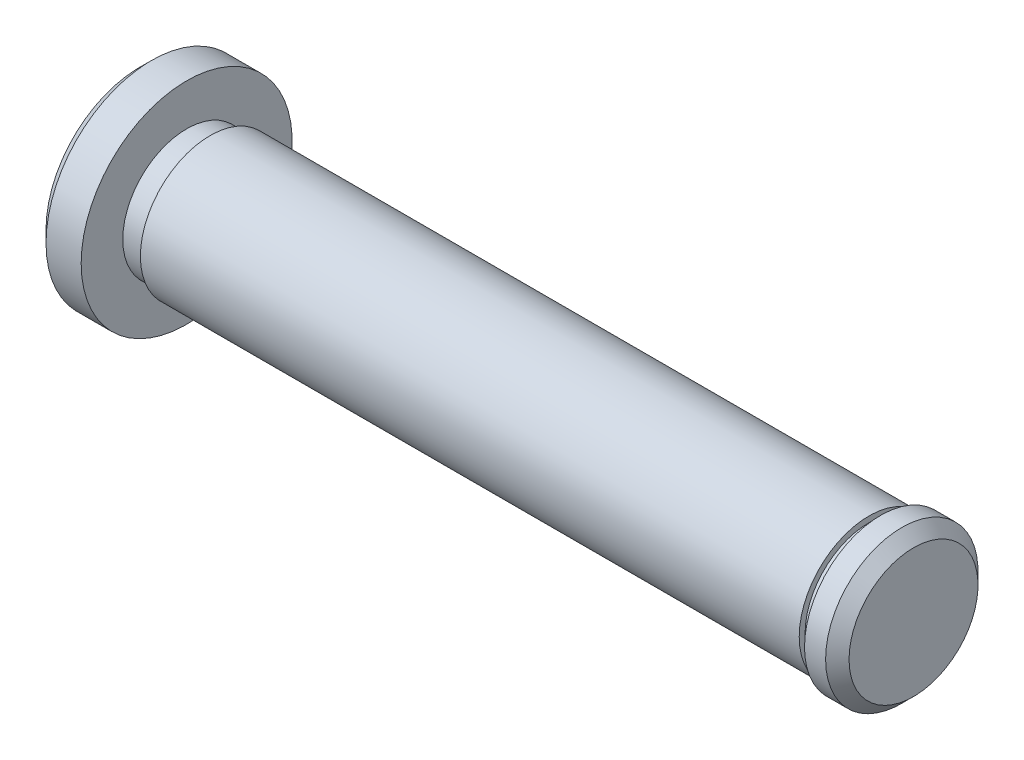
from build123d import *

# Parameters (mm, degrees)
SKETCH_1_W     = 1
SKETCH_1_H     = 5.45
SKETCH_1_W_2   = 4
SKETCH_1_H_2   = 9
SKETCH_1_W_3   = 2
SKETCH_1_W_4   = 2.8
SKETCH_1_H_3   = 6.5
CHAMFER_1_SIZE = 1


with BuildPart() as part:
    # Sketch 1 → Revolve 1 (revolve)
    with BuildSketch(Plane.XY, mode=Mode.PRIVATE) as revolve_1_sk:
        with Locations((62.7, 2.725)):
            Rectangle(SKETCH_1_W, SKETCH_1_H)
        Polygon((6, 5.45), (6, 0), (62.2, 0), (62.2, 5.45), (62.2, 5.95), (6, 5.95), align=None)
        with Locations((2, 4.5)):
            Rectangle(SKETCH_1_W_2, SKETCH_1_H_2)
        with Locations((5, 2.725)):
            Rectangle(SKETCH_1_W_3, SKETCH_1_H)
        with Locations((64.6, 3.25)):
            Rectangle(SKETCH_1_W_4, SKETCH_1_H_3)
    revolve(revolve_1_sk.sketch.rotate(Axis((6, 0, 0), (1, 0, 0)), 90), axis=Axis((6, 0, 0), (1, 0, 0)))

    # Chamfer 1
    chamfer_1_edges = [part.edges().sort_by_distance(p)[0] for p in [
        (0, 0, -9),
        (66, 0, -6.5),
    ]]
    chamfer(chamfer_1_edges, length=CHAMFER_1_SIZE)


solid = part.part
